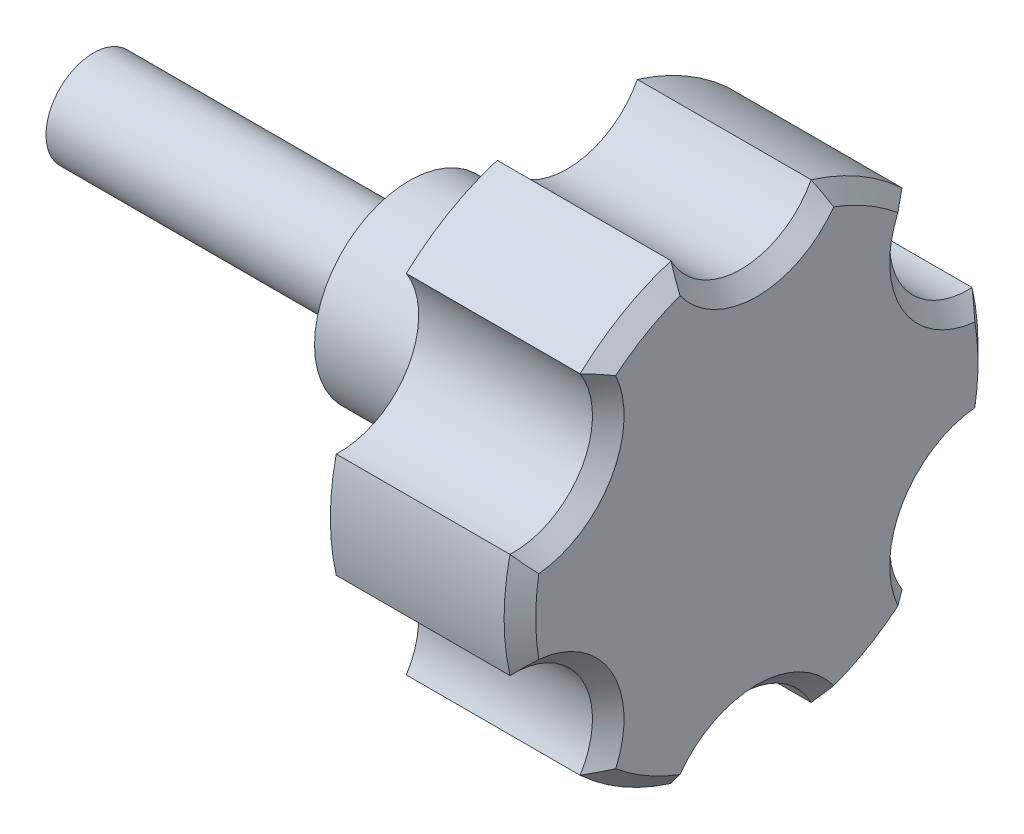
from build123d import *

# Parameters (mm, degrees)
ENL_V_MAT_EXTRU_1_DEPTH      = 48.053161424
R_P_TITION_CIRCULAIRE1_COUNT = 6
CHANFREIN1_SIZE              = 1


with BuildPart() as part:
    # Esquisse1 → R_volution1 (revolve)
    with BuildSketch(Plane.XY, mode=Mode.PRIVATE) as r_volution1_sk:
        Polygon((0, 0), (0, 3), (20, 3), (20, 6), (30, 6), (30, 15), (42, 15), (42, 0), align=None)
    revolve(r_volution1_sk.sketch.rotate(Axis((-15.938926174, 0, 0), (1, 0, 0)), 90), axis=Axis((-15.938926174, 0, 0), (1, 0, 0)))

    # Esquisse2 → Enl_v. mat.-Extru.1 (cut, through all)
    with BuildSketch(Plane(origin=(42, 0, 0), x_dir=(0, 0, -1), z_dir=(1, 0, 0))):
        with BuildLine():
            Line((-4.952877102, 15.950576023), (4.952877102, 15.950576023))
            ThreePointArc((4.952877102, 15.950576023), (0, 11.635417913), (-4.952877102, 15.950576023))
        make_face()
    enl_v_mat_extru_1 = extrude(amount=-ENL_V_MAT_EXTRU_1_DEPTH, mode=Mode.SUBTRACT)

    # R_p_tition circulaire1: Enl_v. mat.-Extru.1 ×6 about axis
    r_p_tition_circulaire1_axis = Axis((-15.938926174, 0, 0), (1, 0, 0))
    for i in range(1, R_P_TITION_CIRCULAIRE1_COUNT):
        add(enl_v_mat_extru_1.rotate(r_p_tition_circulaire1_axis, i * 360 / R_P_TITION_CIRCULAIRE1_COUNT), mode=Mode.SUBTRACT)

    # Chanfrein1
    chanfrein1_edges = [part.edges().sort_by_distance(p)[0] for p in [
        (42, -5.817708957, 10.076567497),
        (42, -12.990381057, 7.5),
        (42, -11.635417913, 0),
        (42, -12.990381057, -7.5),
        (42, -5.817708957, -10.076567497),
        (42, 0, -15),
        (42, 5.817708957, -10.076567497),
        (42, 12.990381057, -7.5),
        (42, 11.635417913, 0),
        (42, 12.990381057, 7.5),
        (42, 5.817708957, 10.076567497),
        (42, 0, 15),
    ]]
    chamfer(chanfrein1_edges, length=CHANFREIN1_SIZE)


solid = part.part
